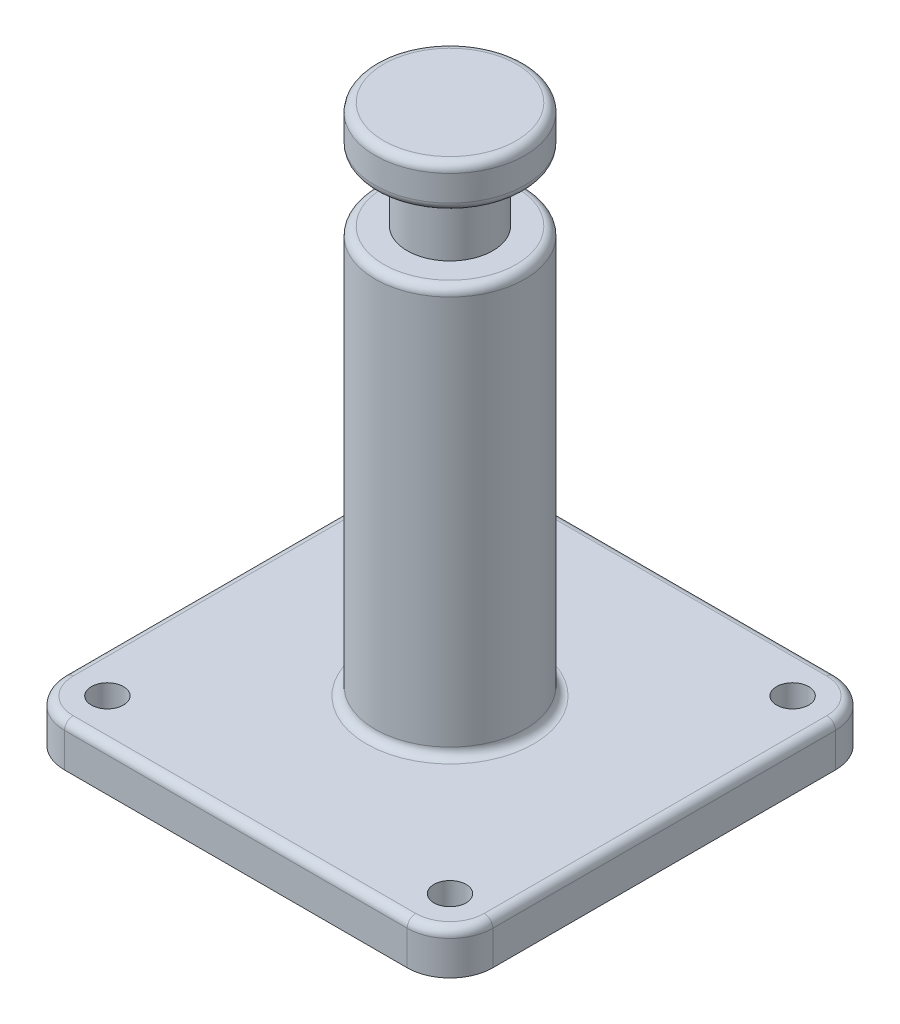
ISO-10303-21;
HEADER;
FILE_DESCRIPTION(('STEP AP214'),'2;1');
FILE_NAME('part.step','',(''),(''),'','','');
FILE_SCHEMA(('AUTOMOTIVE_DESIGN { 1 0 10303 214 1 1 1 1 }'));
ENDSEC;
DATA;
#1=APPLICATION_CONTEXT('core data for automotive mechanical design processes');
#2=APPLICATION_PROTOCOL_DEFINITION('international standard','automotive_design',2000,#1);
#3=PRODUCT_CONTEXT('',#1,'mechanical');
#4=PRODUCT('Part','Part','',(#3));
#5=PRODUCT_RELATED_PRODUCT_CATEGORY('part','',(#4));
#6=PRODUCT_DEFINITION_FORMATION('','',#4);
#7=PRODUCT_DEFINITION_CONTEXT('part definition',#1,'design');
#8=PRODUCT_DEFINITION('design','',#6,#7);
#9=PRODUCT_DEFINITION_SHAPE('','',#8);
#10=(LENGTH_UNIT() NAMED_UNIT(*) SI_UNIT(.MILLI.,.METRE.));
#11=(NAMED_UNIT(*) PLANE_ANGLE_UNIT() SI_UNIT($,.RADIAN.));
#12=(NAMED_UNIT(*) SI_UNIT($,.STERADIAN.) SOLID_ANGLE_UNIT());
#13=UNCERTAINTY_MEASURE_WITH_UNIT(LENGTH_MEASURE(1.E-05),#10,'distance_accuracy_value','');
#14=(GEOMETRIC_REPRESENTATION_CONTEXT(3) GLOBAL_UNCERTAINTY_ASSIGNED_CONTEXT((#13)) GLOBAL_UNIT_ASSIGNED_CONTEXT((#10,
#11,#12)) REPRESENTATION_CONTEXT('',''));
#15=CARTESIAN_POINT('',(0.,0.,0.));
#16=DIRECTION('',(0.,0.,1.));
#17=DIRECTION('',(1.,0.,0.));
#18=AXIS2_PLACEMENT_3D('',#15,#16,#17);
#19=CARTESIAN_POINT('',(50.8,12.7,50.8));
#20=DIRECTION('',(0.,1.,0.));
#21=DIRECTION('',(0.,0.,1.));
#22=AXIS2_PLACEMENT_3D('',#19,#20,#21);
#23=PLANE('',#22);
#24=DIRECTION('',(0.,0.,1.));
#25=VECTOR('',#24,1.);
#26=CARTESIAN_POINT('',(-60.96,12.7,50.7999999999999));
#27=LINE('',#26,#25);
#28=CARTESIAN_POINT('',(-60.96,12.7,-50.7999999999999));
#29=VERTEX_POINT('',#28);
#30=CARTESIAN_POINT('',(-60.96,12.7,50.7999999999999));
#31=VERTEX_POINT('',#30);
#32=EDGE_CURVE('E194',#29,#31,#27,.T.);
#33=ORIENTED_EDGE('',*,*,#32,.T.);
#34=CARTESIAN_POINT('',(-50.8,12.7,50.8));
#35=DIRECTION('',(0.,1.,0.));
#36=DIRECTION('',(0.,0.,1.));
#37=AXIS2_PLACEMENT_3D('',#34,#35,#36);
#38=CIRCLE('',#37,10.16);
#39=CARTESIAN_POINT('',(-50.7999999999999,12.7,60.96));
#40=VERTEX_POINT('',#39);
#41=EDGE_CURVE('E196',#31,#40,#38,.T.);
#42=ORIENTED_EDGE('',*,*,#41,.T.);
#43=DIRECTION('',(1.,0.,0.));
#44=VECTOR('',#43,1.);
#45=CARTESIAN_POINT('',(50.7999999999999,12.7,60.96));
#46=LINE('',#45,#44);
#47=CARTESIAN_POINT('',(50.7999999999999,12.7,60.96));
#48=VERTEX_POINT('',#47);
#49=EDGE_CURVE('E182',#40,#48,#46,.T.);
#50=ORIENTED_EDGE('',*,*,#49,.T.);
#51=CARTESIAN_POINT('',(50.8,12.7,50.8));
#52=DIRECTION('',(0.,1.,0.));
#53=DIRECTION('',(0.,0.,1.));
#54=AXIS2_PLACEMENT_3D('',#51,#52,#53);
#55=CIRCLE('',#54,10.16);
#56=CARTESIAN_POINT('',(60.96,12.7,50.7999999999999));
#57=VERTEX_POINT('',#56);
#58=EDGE_CURVE('E184',#48,#57,#55,.T.);
#59=ORIENTED_EDGE('',*,*,#58,.T.);
#60=DIRECTION('',(0.,0.,-1.));
#61=VECTOR('',#60,1.);
#62=CARTESIAN_POINT('',(60.96,12.7,-50.7999999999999));
#63=LINE('',#62,#61);
#64=CARTESIAN_POINT('',(60.96,12.7,-50.7999999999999));
#65=VERTEX_POINT('',#64);
#66=EDGE_CURVE('E186',#57,#65,#63,.T.);
#67=ORIENTED_EDGE('',*,*,#66,.T.);
#68=CARTESIAN_POINT('',(50.8,12.7,-50.8));
#69=DIRECTION('',(0.,1.,0.));
#70=DIRECTION('',(0.,0.,1.));
#71=AXIS2_PLACEMENT_3D('',#68,#69,#70);
#72=CIRCLE('',#71,10.16);
#73=CARTESIAN_POINT('',(50.7999999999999,12.7,-60.96));
#74=VERTEX_POINT('',#73);
#75=EDGE_CURVE('E188',#65,#74,#72,.T.);
#76=ORIENTED_EDGE('',*,*,#75,.T.);
#77=DIRECTION('',(-1.,0.,0.));
#78=VECTOR('',#77,1.);
#79=CARTESIAN_POINT('',(-50.7999999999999,12.7,-60.96));
#80=LINE('',#79,#78);
#81=CARTESIAN_POINT('',(-50.7999999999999,12.7,-60.96));
#82=VERTEX_POINT('',#81);
#83=EDGE_CURVE('E190',#74,#82,#80,.T.);
#84=ORIENTED_EDGE('',*,*,#83,.T.);
#85=CARTESIAN_POINT('',(-50.8,12.7,-50.8));
#86=DIRECTION('',(0.,1.,0.));
#87=DIRECTION('',(0.,0.,1.));
#88=AXIS2_PLACEMENT_3D('',#85,#86,#87);
#89=CIRCLE('',#88,10.16);
#90=EDGE_CURVE('E192',#82,#29,#89,.T.);
#91=ORIENTED_EDGE('',*,*,#90,.T.);
#92=EDGE_LOOP('',(#33,#42,#50,#59,#67,#76,#84,#91));
#93=FACE_BOUND('',#92,.T.);
#94=CARTESIAN_POINT('',(0.,12.7,0.));
#95=DIRECTION('',(0.,1.,0.));
#96=DIRECTION('',(0.,0.,1.));
#97=AXIS2_PLACEMENT_3D('',#94,#95,#96);
#98=CIRCLE('',#97,24.765);
#99=CARTESIAN_POINT('',(0.,12.7,24.765));
#100=VERTEX_POINT('',#99);
#101=EDGE_CURVE('E131',#100,#100,#98,.F.);
#102=ORIENTED_EDGE('',*,*,#101,.T.);
#103=EDGE_LOOP('',(#102));
#104=FACE_BOUND('',#103,.T.);
#105=CARTESIAN_POINT('',(50.8,12.7,50.8));
#106=DIRECTION('',(0.,1.,0.));
#107=DIRECTION('',(0.,0.,1.));
#108=AXIS2_PLACEMENT_3D('',#105,#106,#107);
#109=CIRCLE('',#108,4.7625);
#110=CARTESIAN_POINT('',(50.8,12.7,55.5625));
#111=VERTEX_POINT('',#110);
#112=EDGE_CURVE('E267',#111,#111,#109,.T.);
#113=ORIENTED_EDGE('',*,*,#112,.F.);
#114=EDGE_LOOP('',(#113));
#115=FACE_BOUND('',#114,.T.);
#116=CARTESIAN_POINT('',(-50.8,12.7,-50.8));
#117=DIRECTION('',(0.,1.,0.));
#118=DIRECTION('',(0.,0.,1.));
#119=AXIS2_PLACEMENT_3D('',#116,#117,#118);
#120=CIRCLE('',#119,4.7625);
#121=CARTESIAN_POINT('',(-50.8,12.7,-46.0375));
#122=VERTEX_POINT('',#121);
#123=EDGE_CURVE('E146',#122,#122,#120,.T.);
#124=ORIENTED_EDGE('',*,*,#123,.F.);
#125=EDGE_LOOP('',(#124));
#126=FACE_BOUND('',#125,.T.);
#127=CARTESIAN_POINT('',(50.8,12.7,-50.8));
#128=DIRECTION('',(0.,1.,0.));
#129=DIRECTION('',(0.,0.,1.));
#130=AXIS2_PLACEMENT_3D('',#127,#128,#129);
#131=CIRCLE('',#130,4.7625);
#132=CARTESIAN_POINT('',(50.8,12.7,-46.0375));
#133=VERTEX_POINT('',#132);
#134=EDGE_CURVE('E273',#133,#133,#131,.T.);
#135=ORIENTED_EDGE('',*,*,#134,.F.);
#136=EDGE_LOOP('',(#135));
#137=FACE_BOUND('',#136,.T.);
#138=CARTESIAN_POINT('',(-50.8,12.7,50.8));
#139=DIRECTION('',(0.,1.,0.));
#140=DIRECTION('',(0.,0.,1.));
#141=AXIS2_PLACEMENT_3D('',#138,#139,#140);
#142=CIRCLE('',#141,4.7625);
#143=CARTESIAN_POINT('',(-50.8,12.7,55.5625));
#144=VERTEX_POINT('',#143);
#145=EDGE_CURVE('E255',#144,#144,#142,.T.);
#146=ORIENTED_EDGE('',*,*,#145,.F.);
#147=EDGE_LOOP('',(#146));
#148=FACE_BOUND('',#147,.T.);
#149=ADVANCED_FACE('F36',(#93,#104,#115,#126,#137,#148),#23,.T.);
#150=CARTESIAN_POINT('',(50.8,0.,50.8));
#151=DIRECTION('',(0.,1.,0.));
#152=DIRECTION('',(0.,0.,1.));
#153=AXIS2_PLACEMENT_3D('',#150,#151,#152);
#154=PLANE('',#153);
#155=CARTESIAN_POINT('',(50.8,0.,50.8));
#156=DIRECTION('',(0.,1.,0.));
#157=DIRECTION('',(0.,0.,1.));
#158=AXIS2_PLACEMENT_3D('',#155,#156,#157);
#159=CIRCLE('',#158,4.7625);
#160=CARTESIAN_POINT('',(50.8,0.,55.5625));
#161=VERTEX_POINT('',#160);
#162=EDGE_CURVE('E264',#161,#161,#159,.T.);
#163=ORIENTED_EDGE('',*,*,#162,.T.);
#164=EDGE_LOOP('',(#163));
#165=FACE_BOUND('',#164,.T.);
#166=CARTESIAN_POINT('',(-50.8,0.,-50.8));
#167=DIRECTION('',(0.,1.,0.));
#168=DIRECTION('',(0.,0.,1.));
#169=AXIS2_PLACEMENT_3D('',#166,#167,#168);
#170=CIRCLE('',#169,4.7625);
#171=CARTESIAN_POINT('',(-50.8,0.,-46.0375));
#172=VERTEX_POINT('',#171);
#173=EDGE_CURVE('E149',#172,#172,#170,.T.);
#174=ORIENTED_EDGE('',*,*,#173,.T.);
#175=EDGE_LOOP('',(#174));
#176=FACE_BOUND('',#175,.T.);
#177=CARTESIAN_POINT('',(50.8,0.,50.8));
#178=DIRECTION('',(0.,1.,0.));
#179=DIRECTION('',(0.,0.,1.));
#180=AXIS2_PLACEMENT_3D('',#177,#178,#179);
#181=CIRCLE('',#180,12.7);
#182=CARTESIAN_POINT('',(50.7999999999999,0.,63.5));
#183=VERTEX_POINT('',#182);
#184=CARTESIAN_POINT('',(63.5,0.,50.7999999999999));
#185=VERTEX_POINT('',#184);
#186=EDGE_CURVE('E139',#183,#185,#181,.T.);
#187=ORIENTED_EDGE('',*,*,#186,.F.);
#188=DIRECTION('',(1.,0.,0.));
#189=VECTOR('',#188,1.);
#190=CARTESIAN_POINT('',(-50.7999999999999,0.,63.5));
#191=LINE('',#190,#189);
#192=CARTESIAN_POINT('',(-50.7999999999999,0.,63.5));
#193=VERTEX_POINT('',#192);
#194=EDGE_CURVE('E166',#193,#183,#191,.T.);
#195=ORIENTED_EDGE('',*,*,#194,.F.);
#196=CARTESIAN_POINT('',(-50.8,0.,50.8));
#197=DIRECTION('',(0.,1.,0.));
#198=DIRECTION('',(0.,0.,-1.));
#199=AXIS2_PLACEMENT_3D('',#196,#197,#198);
#200=CIRCLE('',#199,12.7);
#201=CARTESIAN_POINT('',(-63.5,0.,50.7999999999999));
#202=VERTEX_POINT('',#201);
#203=EDGE_CURVE('E163',#202,#193,#200,.T.);
#204=ORIENTED_EDGE('',*,*,#203,.F.);
#205=DIRECTION('',(0.,0.,1.));
#206=VECTOR('',#205,1.);
#207=CARTESIAN_POINT('',(-63.5,0.,50.7999999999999));
#208=LINE('',#207,#206);
#209=CARTESIAN_POINT('',(-63.5,0.,-50.7999999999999));
#210=VERTEX_POINT('',#209);
#211=EDGE_CURVE('E160',#210,#202,#208,.T.);
#212=ORIENTED_EDGE('',*,*,#211,.F.);
#213=CARTESIAN_POINT('',(-50.8,0.,-50.8));
#214=DIRECTION('',(0.,1.,0.));
#215=DIRECTION('',(0.,0.,-1.));
#216=AXIS2_PLACEMENT_3D('',#213,#214,#215);
#217=CIRCLE('',#216,12.7);
#218=CARTESIAN_POINT('',(-50.7999999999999,0.,-63.5));
#219=VERTEX_POINT('',#218);
#220=EDGE_CURVE('E157',#219,#210,#217,.T.);
#221=ORIENTED_EDGE('',*,*,#220,.F.);
#222=DIRECTION('',(-1.,0.,0.));
#223=VECTOR('',#222,1.);
#224=CARTESIAN_POINT('',(-50.7999999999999,0.,-63.5));
#225=LINE('',#224,#223);
#226=CARTESIAN_POINT('',(50.7999999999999,0.,-63.5));
#227=VERTEX_POINT('',#226);
#228=EDGE_CURVE('E154',#227,#219,#225,.T.);
#229=ORIENTED_EDGE('',*,*,#228,.F.);
#230=CARTESIAN_POINT('',(50.8,0.,-50.8));
#231=DIRECTION('',(0.,1.,0.));
#232=DIRECTION('',(0.,0.,-1.));
#233=AXIS2_PLACEMENT_3D('',#230,#231,#232);
#234=CIRCLE('',#233,12.7);
#235=CARTESIAN_POINT('',(63.5,0.,-50.7999999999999));
#236=VERTEX_POINT('',#235);
#237=EDGE_CURVE('E142',#236,#227,#234,.T.);
#238=ORIENTED_EDGE('',*,*,#237,.F.);
#239=DIRECTION('',(0.,0.,-1.));
#240=VECTOR('',#239,1.);
#241=CARTESIAN_POINT('',(63.5,0.,50.7999999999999));
#242=LINE('',#241,#240);
#243=EDGE_CURVE('E127',#185,#236,#242,.T.);
#244=ORIENTED_EDGE('',*,*,#243,.F.);
#245=EDGE_LOOP('',(#187,#195,#204,#212,#221,#229,#238,#244));
#246=FACE_BOUND('',#245,.T.);
#247=CARTESIAN_POINT('',(50.8,0.,-50.8));
#248=DIRECTION('',(0.,1.,0.));
#249=DIRECTION('',(0.,0.,1.));
#250=AXIS2_PLACEMENT_3D('',#247,#248,#249);
#251=CIRCLE('',#250,4.7625);
#252=CARTESIAN_POINT('',(50.8,0.,-46.0375));
#253=VERTEX_POINT('',#252);
#254=EDGE_CURVE('E270',#253,#253,#251,.T.);
#255=ORIENTED_EDGE('',*,*,#254,.T.);
#256=EDGE_LOOP('',(#255));
#257=FACE_BOUND('',#256,.T.);
#258=CARTESIAN_POINT('',(-50.8,0.,50.8));
#259=DIRECTION('',(0.,1.,0.));
#260=DIRECTION('',(0.,0.,1.));
#261=AXIS2_PLACEMENT_3D('',#258,#259,#260);
#262=CIRCLE('',#261,4.7625);
#263=CARTESIAN_POINT('',(-50.8,0.,55.5625));
#264=VERTEX_POINT('',#263);
#265=EDGE_CURVE('E251',#264,#264,#262,.T.);
#266=ORIENTED_EDGE('',*,*,#265,.T.);
#267=EDGE_LOOP('',(#266));
#268=FACE_BOUND('',#267,.T.);
#269=ADVANCED_FACE('F136',(#165,#176,#246,#257,#268),#154,.F.);
#270=CARTESIAN_POINT('',(50.8,12.7,50.8));
#271=DIRECTION('',(0.,-1.,0.));
#272=DIRECTION('',(0.,0.,-1.));
#273=AXIS2_PLACEMENT_3D('',#270,#271,#272);
#274=CYLINDRICAL_SURFACE('',#273,12.7);
#275=DIRECTION('',(0.,-1.,0.));
#276=VECTOR('',#275,1.);
#277=CARTESIAN_POINT('',(63.5,12.7,50.7999999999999));
#278=LINE('',#277,#276);
#279=CARTESIAN_POINT('',(63.5,10.16,50.7999999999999));
#280=VERTEX_POINT('',#279);
#281=EDGE_CURVE('E124',#280,#185,#278,.T.);
#282=ORIENTED_EDGE('',*,*,#281,.F.);
#283=CARTESIAN_POINT('',(50.8,10.16,50.8));
#284=DIRECTION('',(0.,1.,0.));
#285=DIRECTION('',(0.,0.,1.));
#286=AXIS2_PLACEMENT_3D('',#283,#284,#285);
#287=CIRCLE('',#286,12.7);
#288=CARTESIAN_POINT('',(50.7999999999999,10.16,63.5));
#289=VERTEX_POINT('',#288);
#290=EDGE_CURVE('E51',#280,#289,#287,.F.);
#291=ORIENTED_EDGE('',*,*,#290,.T.);
#292=DIRECTION('',(0.,-1.,0.));
#293=VECTOR('',#292,1.);
#294=CARTESIAN_POINT('',(50.7999999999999,12.7,63.5));
#295=LINE('',#294,#293);
#296=EDGE_CURVE('E144',#289,#183,#295,.T.);
#297=ORIENTED_EDGE('',*,*,#296,.T.);
#298=ORIENTED_EDGE('',*,*,#186,.T.);
#299=EDGE_LOOP('',(#282,#291,#297,#298));
#300=FACE_BOUND('',#299,.T.);
#301=ADVANCED_FACE('F38',(#300),#274,.T.);
#302=CARTESIAN_POINT('',(63.5,12.7,50.7999999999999));
#303=DIRECTION('',(-1.,0.,0.));
#304=DIRECTION('',(0.,0.,1.));
#305=AXIS2_PLACEMENT_3D('',#302,#303,#304);
#306=PLANE('',#305);
#307=DIRECTION('',(0.,-1.,0.));
#308=VECTOR('',#307,1.);
#309=CARTESIAN_POINT('',(63.5,12.7,-50.7999999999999));
#310=LINE('',#309,#308);
#311=CARTESIAN_POINT('',(63.5,10.16,-50.7999999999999));
#312=VERTEX_POINT('',#311);
#313=EDGE_CURVE('E132',#312,#236,#310,.T.);
#314=ORIENTED_EDGE('',*,*,#313,.F.);
#315=DIRECTION('',(0.,0.,-1.));
#316=VECTOR('',#315,1.);
#317=CARTESIAN_POINT('',(63.5,10.16,50.7999999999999));
#318=LINE('',#317,#316);
#319=EDGE_CURVE('E59',#312,#280,#318,.F.);
#320=ORIENTED_EDGE('',*,*,#319,.T.);
#321=ORIENTED_EDGE('',*,*,#281,.T.);
#322=ORIENTED_EDGE('',*,*,#243,.T.);
#323=EDGE_LOOP('',(#314,#320,#321,#322));
#324=FACE_BOUND('',#323,.T.);
#325=ADVANCED_FACE('F126',(#324),#306,.F.);
#326=CARTESIAN_POINT('',(50.8,12.7,-50.8));
#327=DIRECTION('',(0.,-1.,0.));
#328=DIRECTION('',(0.,0.,-1.));
#329=AXIS2_PLACEMENT_3D('',#326,#327,#328);
#330=CYLINDRICAL_SURFACE('',#329,12.7);
#331=DIRECTION('',(0.,-1.,0.));
#332=VECTOR('',#331,1.);
#333=CARTESIAN_POINT('',(50.7999999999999,12.7,-63.5));
#334=LINE('',#333,#332);
#335=CARTESIAN_POINT('',(50.7999999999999,10.16,-63.5));
#336=VERTEX_POINT('',#335);
#337=EDGE_CURVE('E177',#336,#227,#334,.T.);
#338=ORIENTED_EDGE('',*,*,#337,.F.);
#339=CARTESIAN_POINT('',(50.8,10.16,-50.8));
#340=DIRECTION('',(0.,1.,0.));
#341=DIRECTION('',(0.,0.,1.));
#342=AXIS2_PLACEMENT_3D('',#339,#340,#341);
#343=CIRCLE('',#342,12.7);
#344=EDGE_CURVE('E208',#336,#312,#343,.F.);
#345=ORIENTED_EDGE('',*,*,#344,.T.);
#346=ORIENTED_EDGE('',*,*,#313,.T.);
#347=ORIENTED_EDGE('',*,*,#237,.T.);
#348=EDGE_LOOP('',(#338,#345,#346,#347));
#349=FACE_BOUND('',#348,.T.);
#350=ADVANCED_FACE('F319',(#349),#330,.T.);
#351=CARTESIAN_POINT('',(-50.7999999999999,12.7,-63.5));
#352=DIRECTION('',(0.,0.,1.));
#353=DIRECTION('',(1.,0.,0.));
#354=AXIS2_PLACEMENT_3D('',#351,#352,#353);
#355=PLANE('',#354);
#356=DIRECTION('',(0.,-1.,0.));
#357=VECTOR('',#356,1.);
#358=CARTESIAN_POINT('',(-50.7999999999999,12.7,-63.5));
#359=LINE('',#358,#357);
#360=CARTESIAN_POINT('',(-50.7999999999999,10.16,-63.5));
#361=VERTEX_POINT('',#360);
#362=EDGE_CURVE('E175',#361,#219,#359,.T.);
#363=ORIENTED_EDGE('',*,*,#362,.F.);
#364=DIRECTION('',(-1.,0.,0.));
#365=VECTOR('',#364,1.);
#366=CARTESIAN_POINT('',(50.7999999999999,10.16,-63.5));
#367=LINE('',#366,#365);
#368=EDGE_CURVE('E206',#361,#336,#367,.F.);
#369=ORIENTED_EDGE('',*,*,#368,.T.);
#370=ORIENTED_EDGE('',*,*,#337,.T.);
#371=ORIENTED_EDGE('',*,*,#228,.T.);
#372=EDGE_LOOP('',(#363,#369,#370,#371));
#373=FACE_BOUND('',#372,.T.);
#374=ADVANCED_FACE('F315',(#373),#355,.F.);
#375=CARTESIAN_POINT('',(-50.8,12.7,-50.8));
#376=DIRECTION('',(0.,-1.,0.));
#377=DIRECTION('',(0.,0.,-1.));
#378=AXIS2_PLACEMENT_3D('',#375,#376,#377);
#379=CYLINDRICAL_SURFACE('',#378,12.7);
#380=DIRECTION('',(0.,-1.,0.));
#381=VECTOR('',#380,1.);
#382=CARTESIAN_POINT('',(-63.5,12.7,-50.7999999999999));
#383=LINE('',#382,#381);
#384=CARTESIAN_POINT('',(-63.5,10.16,-50.7999999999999));
#385=VERTEX_POINT('',#384);
#386=EDGE_CURVE('E173',#385,#210,#383,.T.);
#387=ORIENTED_EDGE('',*,*,#386,.F.);
#388=CARTESIAN_POINT('',(-50.8,10.16,-50.8));
#389=DIRECTION('',(0.,1.,0.));
#390=DIRECTION('',(0.,0.,1.));
#391=AXIS2_PLACEMENT_3D('',#388,#389,#390);
#392=CIRCLE('',#391,12.7);
#393=EDGE_CURVE('E204',#385,#361,#392,.F.);
#394=ORIENTED_EDGE('',*,*,#393,.T.);
#395=ORIENTED_EDGE('',*,*,#362,.T.);
#396=ORIENTED_EDGE('',*,*,#220,.T.);
#397=EDGE_LOOP('',(#387,#394,#395,#396));
#398=FACE_BOUND('',#397,.T.);
#399=ADVANCED_FACE('F311',(#398),#379,.T.);
#400=CARTESIAN_POINT('',(-63.5,12.7,50.7999999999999));
#401=DIRECTION('',(1.,0.,0.));
#402=DIRECTION('',(0.,0.,-1.));
#403=AXIS2_PLACEMENT_3D('',#400,#401,#402);
#404=PLANE('',#403);
#405=DIRECTION('',(0.,-1.,0.));
#406=VECTOR('',#405,1.);
#407=CARTESIAN_POINT('',(-63.5,12.7,50.7999999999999));
#408=LINE('',#407,#406);
#409=CARTESIAN_POINT('',(-63.5,10.16,50.7999999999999));
#410=VERTEX_POINT('',#409);
#411=EDGE_CURVE('E171',#410,#202,#408,.T.);
#412=ORIENTED_EDGE('',*,*,#411,.F.);
#413=DIRECTION('',(0.,0.,1.));
#414=VECTOR('',#413,1.);
#415=CARTESIAN_POINT('',(-63.5,10.16,-50.7999999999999));
#416=LINE('',#415,#414);
#417=EDGE_CURVE('E202',#410,#385,#416,.F.);
#418=ORIENTED_EDGE('',*,*,#417,.T.);
#419=ORIENTED_EDGE('',*,*,#386,.T.);
#420=ORIENTED_EDGE('',*,*,#211,.T.);
#421=EDGE_LOOP('',(#412,#418,#419,#420));
#422=FACE_BOUND('',#421,.T.);
#423=ADVANCED_FACE('F307',(#422),#404,.F.);
#424=CARTESIAN_POINT('',(-50.8,12.7,50.8));
#425=DIRECTION('',(0.,-1.,0.));
#426=DIRECTION('',(0.,0.,-1.));
#427=AXIS2_PLACEMENT_3D('',#424,#425,#426);
#428=CYLINDRICAL_SURFACE('',#427,12.7);
#429=DIRECTION('',(0.,-1.,0.));
#430=VECTOR('',#429,1.);
#431=CARTESIAN_POINT('',(-50.7999999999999,12.7,63.5));
#432=LINE('',#431,#430);
#433=CARTESIAN_POINT('',(-50.7999999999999,10.16,63.5));
#434=VERTEX_POINT('',#433);
#435=EDGE_CURVE('E169',#434,#193,#432,.T.);
#436=ORIENTED_EDGE('',*,*,#435,.F.);
#437=CARTESIAN_POINT('',(-50.8,10.16,50.8));
#438=DIRECTION('',(0.,1.,0.));
#439=DIRECTION('',(0.,0.,1.));
#440=AXIS2_PLACEMENT_3D('',#437,#438,#439);
#441=CIRCLE('',#440,12.7);
#442=EDGE_CURVE('E199',#434,#410,#441,.F.);
#443=ORIENTED_EDGE('',*,*,#442,.T.);
#444=ORIENTED_EDGE('',*,*,#411,.T.);
#445=ORIENTED_EDGE('',*,*,#203,.T.);
#446=EDGE_LOOP('',(#436,#443,#444,#445));
#447=FACE_BOUND('',#446,.T.);
#448=ADVANCED_FACE('F292',(#447),#428,.T.);
#449=CARTESIAN_POINT('',(-50.7999999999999,12.7,63.5));
#450=DIRECTION('',(0.,0.,-1.));
#451=DIRECTION('',(-1.,0.,0.));
#452=AXIS2_PLACEMENT_3D('',#449,#450,#451);
#453=PLANE('',#452);
#454=ORIENTED_EDGE('',*,*,#296,.F.);
#455=DIRECTION('',(1.,0.,0.));
#456=VECTOR('',#455,1.);
#457=CARTESIAN_POINT('',(-50.7999999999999,10.16,63.5));
#458=LINE('',#457,#456);
#459=EDGE_CURVE('E212',#289,#434,#458,.F.);
#460=ORIENTED_EDGE('',*,*,#459,.T.);
#461=ORIENTED_EDGE('',*,*,#435,.T.);
#462=ORIENTED_EDGE('',*,*,#194,.T.);
#463=EDGE_LOOP('',(#454,#460,#461,#462));
#464=FACE_BOUND('',#463,.T.);
#465=ADVANCED_FACE('F282',(#464),#453,.F.);
#466=CARTESIAN_POINT('',(-50.8,12.7,-50.8));
#467=DIRECTION('',(0.,-1.,0.));
#468=DIRECTION('',(0.,0.,-1.));
#469=AXIS2_PLACEMENT_3D('',#466,#467,#468);
#470=CYLINDRICAL_SURFACE('',#469,4.7625);
#471=ORIENTED_EDGE('',*,*,#123,.T.);
#472=EDGE_LOOP('',(#471));
#473=FACE_BOUND('',#472,.T.);
#474=ORIENTED_EDGE('',*,*,#173,.F.);
#475=EDGE_LOOP('',(#474));
#476=FACE_BOUND('',#475,.T.);
#477=ADVANCED_FACE('F279',(#473,#476),#470,.F.);
#478=CARTESIAN_POINT('',(50.8,12.7,-50.8));
#479=DIRECTION('',(0.,-1.,0.));
#480=DIRECTION('',(0.,0.,-1.));
#481=AXIS2_PLACEMENT_3D('',#478,#479,#480);
#482=CYLINDRICAL_SURFACE('',#481,4.7625);
#483=ORIENTED_EDGE('',*,*,#134,.T.);
#484=EDGE_LOOP('',(#483));
#485=FACE_BOUND('',#484,.T.);
#486=ORIENTED_EDGE('',*,*,#254,.F.);
#487=EDGE_LOOP('',(#486));
#488=FACE_BOUND('',#487,.T.);
#489=ADVANCED_FACE('F281',(#485,#488),#482,.F.);
#490=CARTESIAN_POINT('',(50.8,12.7,50.8));
#491=DIRECTION('',(0.,-1.,0.));
#492=DIRECTION('',(0.,0.,-1.));
#493=AXIS2_PLACEMENT_3D('',#490,#491,#492);
#494=CYLINDRICAL_SURFACE('',#493,4.7625);
#495=ORIENTED_EDGE('',*,*,#112,.T.);
#496=EDGE_LOOP('',(#495));
#497=FACE_BOUND('',#496,.T.);
#498=ORIENTED_EDGE('',*,*,#162,.F.);
#499=EDGE_LOOP('',(#498));
#500=FACE_BOUND('',#499,.T.);
#501=ADVANCED_FACE('F289',(#497,#500),#494,.F.);
#502=CARTESIAN_POINT('',(-50.8,12.7,50.8));
#503=DIRECTION('',(0.,-1.,0.));
#504=DIRECTION('',(0.,0.,-1.));
#505=AXIS2_PLACEMENT_3D('',#502,#503,#504);
#506=CYLINDRICAL_SURFACE('',#505,4.7625);
#507=ORIENTED_EDGE('',*,*,#145,.T.);
#508=EDGE_LOOP('',(#507));
#509=FACE_BOUND('',#508,.T.);
#510=ORIENTED_EDGE('',*,*,#265,.F.);
#511=EDGE_LOOP('',(#510));
#512=FACE_BOUND('',#511,.T.);
#513=ADVANCED_FACE('F354',(#509,#512),#506,.F.);
#514=CARTESIAN_POINT('',(0.,165.1,0.));
#515=DIRECTION('',(0.,1.,0.));
#516=DIRECTION('',(0.,0.,1.));
#517=AXIS2_PLACEMENT_3D('',#514,#515,#516);
#518=PLANE('',#517);
#519=CARTESIAN_POINT('',(0.,165.1,0.));
#520=DIRECTION('',(0.,1.,0.));
#521=DIRECTION('',(0.,0.,1.));
#522=AXIS2_PLACEMENT_3D('',#519,#520,#521);
#523=CIRCLE('',#522,19.685);
#524=CARTESIAN_POINT('',(0.,165.1,19.685));
#525=VERTEX_POINT('',#524);
#526=EDGE_CURVE('E11',#525,#525,#523,.T.);
#527=ORIENTED_EDGE('',*,*,#526,.T.);
#528=EDGE_LOOP('',(#527));
#529=FACE_BOUND('',#528,.T.);
#530=ADVANCED_FACE('F364',(#529),#518,.T.);
#531=CARTESIAN_POINT('',(0.,0.,0.));
#532=DIRECTION('',(0.,-1.,0.));
#533=DIRECTION('',(0.,0.,-1.));
#534=AXIS2_PLACEMENT_3D('',#531,#532,#533);
#535=CYLINDRICAL_SURFACE('',#534,22.225);
#536=CARTESIAN_POINT('',(0.,154.94,0.));
#537=DIRECTION('',(0.,-1.,0.));
#538=DIRECTION('',(0.,0.,-1.));
#539=AXIS2_PLACEMENT_3D('',#536,#537,#538);
#540=CIRCLE('',#539,22.225);
#541=CARTESIAN_POINT('',(0.,154.94,-22.225));
#542=VERTEX_POINT('',#541);
#543=EDGE_CURVE('E44',#542,#542,#540,.F.);
#544=ORIENTED_EDGE('',*,*,#543,.T.);
#545=EDGE_LOOP('',(#544));
#546=FACE_BOUND('',#545,.T.);
#547=CARTESIAN_POINT('',(0.,162.56,0.));
#548=DIRECTION('',(0.,1.,0.));
#549=DIRECTION('',(0.,0.,1.));
#550=AXIS2_PLACEMENT_3D('',#547,#548,#549);
#551=CIRCLE('',#550,22.225);
#552=CARTESIAN_POINT('',(0.,162.56,22.225));
#553=VERTEX_POINT('',#552);
#554=EDGE_CURVE('E226',#553,#553,#551,.F.);
#555=ORIENTED_EDGE('',*,*,#554,.T.);
#556=EDGE_LOOP('',(#555));
#557=FACE_BOUND('',#556,.T.);
#558=ADVANCED_FACE('F231',(#546,#557),#535,.T.);
#559=CARTESIAN_POINT('',(22.225,152.4,0.));
#560=DIRECTION('',(0.,-1.,0.));
#561=DIRECTION('',(0.,0.,-1.));
#562=AXIS2_PLACEMENT_3D('',#559,#560,#561);
#563=PLANE('',#562);
#564=CARTESIAN_POINT('',(0.,152.4,0.));
#565=DIRECTION('',(0.,-1.,0.));
#566=DIRECTION('',(0.,0.,-1.));
#567=AXIS2_PLACEMENT_3D('',#564,#565,#566);
#568=CIRCLE('',#567,19.685);
#569=CARTESIAN_POINT('',(0.,152.4,-19.685));
#570=VERTEX_POINT('',#569);
#571=EDGE_CURVE('E223',#570,#570,#568,.T.);
#572=ORIENTED_EDGE('',*,*,#571,.T.);
#573=EDGE_LOOP('',(#572));
#574=FACE_BOUND('',#573,.T.);
#575=CARTESIAN_POINT('',(0.,152.4,0.));
#576=DIRECTION('',(0.,-1.,0.));
#577=DIRECTION('',(0.,0.,-1.));
#578=AXIS2_PLACEMENT_3D('',#575,#576,#577);
#579=CIRCLE('',#578,12.7);
#580=CARTESIAN_POINT('',(0.,152.4,-12.7));
#581=VERTEX_POINT('',#580);
#582=EDGE_CURVE('E249',#581,#581,#579,.T.);
#583=ORIENTED_EDGE('',*,*,#582,.F.);
#584=EDGE_LOOP('',(#583));
#585=FACE_BOUND('',#584,.T.);
#586=ADVANCED_FACE('F242',(#574,#585),#563,.T.);
#587=CARTESIAN_POINT('',(0.,0.,0.));
#588=DIRECTION('',(0.,-1.,0.));
#589=DIRECTION('',(0.,0.,-1.));
#590=AXIS2_PLACEMENT_3D('',#587,#588,#589);
#591=CYLINDRICAL_SURFACE('',#590,12.7);
#592=ORIENTED_EDGE('',*,*,#582,.T.);
#593=EDGE_LOOP('',(#592));
#594=FACE_BOUND('',#593,.T.);
#595=CARTESIAN_POINT('',(0.,133.35,0.));
#596=DIRECTION('',(0.,-1.,0.));
#597=DIRECTION('',(0.,0.,-1.));
#598=AXIS2_PLACEMENT_3D('',#595,#596,#597);
#599=CIRCLE('',#598,12.7);
#600=CARTESIAN_POINT('',(0.,133.35,-12.7));
#601=VERTEX_POINT('',#600);
#602=EDGE_CURVE('E252',#601,#601,#599,.T.);
#603=ORIENTED_EDGE('',*,*,#602,.F.);
#604=EDGE_LOOP('',(#603));
#605=FACE_BOUND('',#604,.T.);
#606=ADVANCED_FACE('F245',(#594,#605),#591,.T.);
#607=CARTESIAN_POINT('',(12.7,133.35,0.));
#608=DIRECTION('',(0.,1.,0.));
#609=DIRECTION('',(0.,0.,1.));
#610=AXIS2_PLACEMENT_3D('',#607,#608,#609);
#611=PLANE('',#610);
#612=CARTESIAN_POINT('',(0.,133.35,0.));
#613=DIRECTION('',(0.,1.,0.));
#614=DIRECTION('',(0.,0.,1.));
#615=AXIS2_PLACEMENT_3D('',#612,#613,#614);
#616=CIRCLE('',#615,19.685);
#617=CARTESIAN_POINT('',(0.,133.35,19.685));
#618=VERTEX_POINT('',#617);
#619=EDGE_CURVE('E220',#618,#618,#616,.T.);
#620=ORIENTED_EDGE('',*,*,#619,.T.);
#621=EDGE_LOOP('',(#620));
#622=FACE_BOUND('',#621,.T.);
#623=ORIENTED_EDGE('',*,*,#602,.T.);
#624=EDGE_LOOP('',(#623));
#625=FACE_BOUND('',#624,.T.);
#626=ADVANCED_FACE('F375',(#622,#625),#611,.T.);
#627=CARTESIAN_POINT('',(0.,0.,0.));
#628=DIRECTION('',(0.,-1.,0.));
#629=DIRECTION('',(0.,0.,-1.));
#630=AXIS2_PLACEMENT_3D('',#627,#628,#629);
#631=CYLINDRICAL_SURFACE('',#630,22.225);
#632=CARTESIAN_POINT('',(0.,15.24,0.));
#633=DIRECTION('',(0.,1.,0.));
#634=DIRECTION('',(0.,0.,1.));
#635=AXIS2_PLACEMENT_3D('',#632,#633,#634);
#636=CIRCLE('',#635,22.225);
#637=CARTESIAN_POINT('',(0.,15.24,22.225));
#638=VERTEX_POINT('',#637);
#639=EDGE_CURVE('E217',#638,#638,#636,.T.);
#640=ORIENTED_EDGE('',*,*,#639,.T.);
#641=EDGE_LOOP('',(#640));
#642=FACE_BOUND('',#641,.T.);
#643=CARTESIAN_POINT('',(0.,130.81,0.));
#644=DIRECTION('',(0.,1.,0.));
#645=DIRECTION('',(0.,0.,1.));
#646=AXIS2_PLACEMENT_3D('',#643,#644,#645);
#647=CIRCLE('',#646,22.225);
#648=CARTESIAN_POINT('',(0.,130.81,22.225));
#649=VERTEX_POINT('',#648);
#650=EDGE_CURVE('E214',#649,#649,#647,.F.);
#651=ORIENTED_EDGE('',*,*,#650,.T.);
#652=EDGE_LOOP('',(#651));
#653=FACE_BOUND('',#652,.T.);
#654=ADVANCED_FACE('F392',(#642,#653),#631,.T.);
#655=CARTESIAN_POINT('',(50.8,10.16,-50.8));
#656=DIRECTION('',(0.,1.,0.));
#657=DIRECTION('',(0.,0.,1.));
#658=AXIS2_PLACEMENT_3D('',#655,#656,#657);
#659=TOROIDAL_SURFACE('',#658,10.16,2.54);
#660=CARTESIAN_POINT('',(60.96,10.16,-50.7999999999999));
#661=DIRECTION('',(0.,0.,1.));
#662=DIRECTION('',(1.,0.,0.));
#663=AXIS2_PLACEMENT_3D('',#660,#661,#662);
#664=CIRCLE('',#663,2.54);
#665=EDGE_CURVE('E639',#312,#65,#664,.T.);
#666=ORIENTED_EDGE('',*,*,#665,.F.);
#667=ORIENTED_EDGE('',*,*,#344,.F.);
#668=CARTESIAN_POINT('',(50.7999999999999,10.16,-60.96));
#669=DIRECTION('',(-1.,0.,0.));
#670=DIRECTION('',(0.,0.,1.));
#671=AXIS2_PLACEMENT_3D('',#668,#669,#670);
#672=CIRCLE('',#671,2.54);
#673=EDGE_CURVE('E258',#74,#336,#672,.T.);
#674=ORIENTED_EDGE('',*,*,#673,.F.);
#675=ORIENTED_EDGE('',*,*,#75,.F.);
#676=EDGE_LOOP('',(#666,#667,#674,#675));
#677=FACE_BOUND('',#676,.T.);
#678=ADVANCED_FACE('F399',(#677),#659,.T.);
#679=CARTESIAN_POINT('',(50.8,10.16,-60.96));
#680=DIRECTION('',(1.,0.,0.));
#681=DIRECTION('',(0.,0.,-1.));
#682=AXIS2_PLACEMENT_3D('',#679,#680,#681);
#683=CYLINDRICAL_SURFACE('',#682,2.54);
#684=ORIENTED_EDGE('',*,*,#673,.T.);
#685=ORIENTED_EDGE('',*,*,#368,.F.);
#686=CARTESIAN_POINT('',(-50.7999999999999,10.16,-60.96));
#687=DIRECTION('',(-1.,0.,0.));
#688=DIRECTION('',(0.,0.,1.));
#689=AXIS2_PLACEMENT_3D('',#686,#687,#688);
#690=CIRCLE('',#689,2.54);
#691=EDGE_CURVE('E636',#82,#361,#690,.T.);
#692=ORIENTED_EDGE('',*,*,#691,.F.);
#693=ORIENTED_EDGE('',*,*,#83,.F.);
#694=EDGE_LOOP('',(#684,#685,#692,#693));
#695=FACE_BOUND('',#694,.T.);
#696=ADVANCED_FACE('F407',(#695),#683,.T.);
#697=CARTESIAN_POINT('',(60.96,10.16,50.8));
#698=DIRECTION('',(0.,0.,1.));
#699=DIRECTION('',(1.,0.,0.));
#700=AXIS2_PLACEMENT_3D('',#697,#698,#699);
#701=CYLINDRICAL_SURFACE('',#700,2.54);
#702=ORIENTED_EDGE('',*,*,#665,.T.);
#703=ORIENTED_EDGE('',*,*,#66,.F.);
#704=CARTESIAN_POINT('',(60.96,10.16,50.7999999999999));
#705=DIRECTION('',(0.,0.,1.));
#706=DIRECTION('',(1.,0.,0.));
#707=AXIS2_PLACEMENT_3D('',#704,#705,#706);
#708=CIRCLE('',#707,2.54);
#709=EDGE_CURVE('E633',#280,#57,#708,.T.);
#710=ORIENTED_EDGE('',*,*,#709,.F.);
#711=ORIENTED_EDGE('',*,*,#319,.F.);
#712=EDGE_LOOP('',(#702,#703,#710,#711));
#713=FACE_BOUND('',#712,.T.);
#714=ADVANCED_FACE('F415',(#713),#701,.T.);
#715=CARTESIAN_POINT('',(-50.8,10.16,-50.8));
#716=DIRECTION('',(0.,1.,0.));
#717=DIRECTION('',(0.,0.,1.));
#718=AXIS2_PLACEMENT_3D('',#715,#716,#717);
#719=TOROIDAL_SURFACE('',#718,10.16,2.54);
#720=ORIENTED_EDGE('',*,*,#691,.T.);
#721=ORIENTED_EDGE('',*,*,#393,.F.);
#722=CARTESIAN_POINT('',(-60.96,10.16,-50.7999999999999));
#723=DIRECTION('',(0.,0.,1.));
#724=DIRECTION('',(1.,0.,0.));
#725=AXIS2_PLACEMENT_3D('',#722,#723,#724);
#726=CIRCLE('',#725,2.54);
#727=EDGE_CURVE('E618',#29,#385,#726,.T.);
#728=ORIENTED_EDGE('',*,*,#727,.F.);
#729=ORIENTED_EDGE('',*,*,#90,.F.);
#730=EDGE_LOOP('',(#720,#721,#728,#729));
#731=FACE_BOUND('',#730,.T.);
#732=ADVANCED_FACE('F423',(#731),#719,.T.);
#733=CARTESIAN_POINT('',(50.8,10.16,50.8));
#734=DIRECTION('',(0.,1.,0.));
#735=DIRECTION('',(0.,0.,1.));
#736=AXIS2_PLACEMENT_3D('',#733,#734,#735);
#737=TOROIDAL_SURFACE('',#736,10.16,2.54);
#738=ORIENTED_EDGE('',*,*,#709,.T.);
#739=ORIENTED_EDGE('',*,*,#58,.F.);
#740=CARTESIAN_POINT('',(50.7999999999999,10.16,60.96));
#741=DIRECTION('',(-1.,0.,0.));
#742=DIRECTION('',(0.,0.,1.));
#743=AXIS2_PLACEMENT_3D('',#740,#741,#742);
#744=CIRCLE('',#743,2.54);
#745=EDGE_CURVE('E613',#289,#48,#744,.T.);
#746=ORIENTED_EDGE('',*,*,#745,.F.);
#747=ORIENTED_EDGE('',*,*,#290,.F.);
#748=EDGE_LOOP('',(#738,#739,#746,#747));
#749=FACE_BOUND('',#748,.T.);
#750=ADVANCED_FACE('F431',(#749),#737,.T.);
#751=CARTESIAN_POINT('',(-60.96,10.16,50.8));
#752=DIRECTION('',(0.,0.,-1.));
#753=DIRECTION('',(-1.,0.,0.));
#754=AXIS2_PLACEMENT_3D('',#751,#752,#753);
#755=CYLINDRICAL_SURFACE('',#754,2.54);
#756=ORIENTED_EDGE('',*,*,#727,.T.);
#757=ORIENTED_EDGE('',*,*,#417,.F.);
#758=CARTESIAN_POINT('',(-60.96,10.16,50.7999999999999));
#759=DIRECTION('',(0.,0.,1.));
#760=DIRECTION('',(1.,0.,0.));
#761=AXIS2_PLACEMENT_3D('',#758,#759,#760);
#762=CIRCLE('',#761,2.54);
#763=EDGE_CURVE('E609',#31,#410,#762,.T.);
#764=ORIENTED_EDGE('',*,*,#763,.F.);
#765=ORIENTED_EDGE('',*,*,#32,.F.);
#766=EDGE_LOOP('',(#756,#757,#764,#765));
#767=FACE_BOUND('',#766,.T.);
#768=ADVANCED_FACE('F439',(#767),#755,.T.);
#769=CARTESIAN_POINT('',(50.8,10.16,60.96));
#770=DIRECTION('',(-1.,0.,0.));
#771=DIRECTION('',(0.,0.,1.));
#772=AXIS2_PLACEMENT_3D('',#769,#770,#771);
#773=CYLINDRICAL_SURFACE('',#772,2.54);
#774=ORIENTED_EDGE('',*,*,#745,.T.);
#775=ORIENTED_EDGE('',*,*,#49,.F.);
#776=CARTESIAN_POINT('',(-50.7999999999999,10.16,60.96));
#777=DIRECTION('',(-1.,0.,0.));
#778=DIRECTION('',(0.,-1.,0.));
#779=AXIS2_PLACEMENT_3D('',#776,#777,#778);
#780=CIRCLE('',#779,2.54);
#781=EDGE_CURVE('E614',#434,#40,#780,.T.);
#782=ORIENTED_EDGE('',*,*,#781,.F.);
#783=ORIENTED_EDGE('',*,*,#459,.F.);
#784=EDGE_LOOP('',(#774,#775,#782,#783));
#785=FACE_BOUND('',#784,.T.);
#786=ADVANCED_FACE('F447',(#785),#773,.T.);
#787=CARTESIAN_POINT('',(-50.8,10.16,50.8));
#788=DIRECTION('',(0.,1.,0.));
#789=DIRECTION('',(0.,0.,1.));
#790=AXIS2_PLACEMENT_3D('',#787,#788,#789);
#791=TOROIDAL_SURFACE('',#790,10.16,2.54);
#792=ORIENTED_EDGE('',*,*,#763,.T.);
#793=ORIENTED_EDGE('',*,*,#442,.F.);
#794=ORIENTED_EDGE('',*,*,#781,.T.);
#795=ORIENTED_EDGE('',*,*,#41,.F.);
#796=EDGE_LOOP('',(#792,#793,#794,#795));
#797=FACE_BOUND('',#796,.T.);
#798=ADVANCED_FACE('F455',(#797),#791,.T.);
#799=CARTESIAN_POINT('',(0.,15.24,0.));
#800=DIRECTION('',(0.,1.,0.));
#801=DIRECTION('',(0.,0.,1.));
#802=AXIS2_PLACEMENT_3D('',#799,#800,#801);
#803=TOROIDAL_SURFACE('',#802,24.765,2.54);
#804=ORIENTED_EDGE('',*,*,#101,.F.);
#805=EDGE_LOOP('',(#804));
#806=FACE_BOUND('',#805,.T.);
#807=ORIENTED_EDGE('',*,*,#639,.F.);
#808=EDGE_LOOP('',(#807));
#809=FACE_BOUND('',#808,.T.);
#810=ADVANCED_FACE('F463',(#806,#809),#803,.F.);
#811=CARTESIAN_POINT('',(0.,130.81,0.));
#812=DIRECTION('',(0.,1.,0.));
#813=DIRECTION('',(0.,0.,1.));
#814=AXIS2_PLACEMENT_3D('',#811,#812,#813);
#815=TOROIDAL_SURFACE('',#814,19.685,2.54);
#816=ORIENTED_EDGE('',*,*,#619,.F.);
#817=EDGE_LOOP('',(#816));
#818=FACE_BOUND('',#817,.T.);
#819=ORIENTED_EDGE('',*,*,#650,.F.);
#820=EDGE_LOOP('',(#819));
#821=FACE_BOUND('',#820,.T.);
#822=ADVANCED_FACE('F238',(#818,#821),#815,.T.);
#823=CARTESIAN_POINT('',(0.,154.94,0.));
#824=DIRECTION('',(0.,-1.,0.));
#825=DIRECTION('',(0.,0.,-1.));
#826=AXIS2_PLACEMENT_3D('',#823,#824,#825);
#827=TOROIDAL_SURFACE('',#826,19.685,2.54);
#828=ORIENTED_EDGE('',*,*,#543,.F.);
#829=EDGE_LOOP('',(#828));
#830=FACE_BOUND('',#829,.T.);
#831=ORIENTED_EDGE('',*,*,#571,.F.);
#832=EDGE_LOOP('',(#831));
#833=FACE_BOUND('',#832,.T.);
#834=ADVANCED_FACE('F234',(#830,#833),#827,.T.);
#835=CARTESIAN_POINT('',(0.,162.56,0.));
#836=DIRECTION('',(0.,1.,0.));
#837=DIRECTION('',(0.,0.,1.));
#838=AXIS2_PLACEMENT_3D('',#835,#836,#837);
#839=TOROIDAL_SURFACE('',#838,19.685,2.54);
#840=ORIENTED_EDGE('',*,*,#526,.F.);
#841=EDGE_LOOP('',(#840));
#842=FACE_BOUND('',#841,.T.);
#843=ORIENTED_EDGE('',*,*,#554,.F.);
#844=EDGE_LOOP('',(#843));
#845=FACE_BOUND('',#844,.T.);
#846=ADVANCED_FACE('F237',(#842,#845),#839,.T.);
#847=CLOSED_SHELL('',(#149,#269,#301,#325,#350,#374,#399,#423,#448,#465,#477,#489,#501,#513,
#530,#558,#586,#606,#626,#654,#678,#696,#714,#732,#750,#768,#786,#798,#810,#822,#834,#846));
#848=MANIFOLD_SOLID_BREP('B2',#847);
#849=ADVANCED_BREP_SHAPE_REPRESENTATION('',(#18,#848),#14);
#850=SHAPE_DEFINITION_REPRESENTATION(#9,#849);
ENDSEC;
END-ISO-10303-21;
